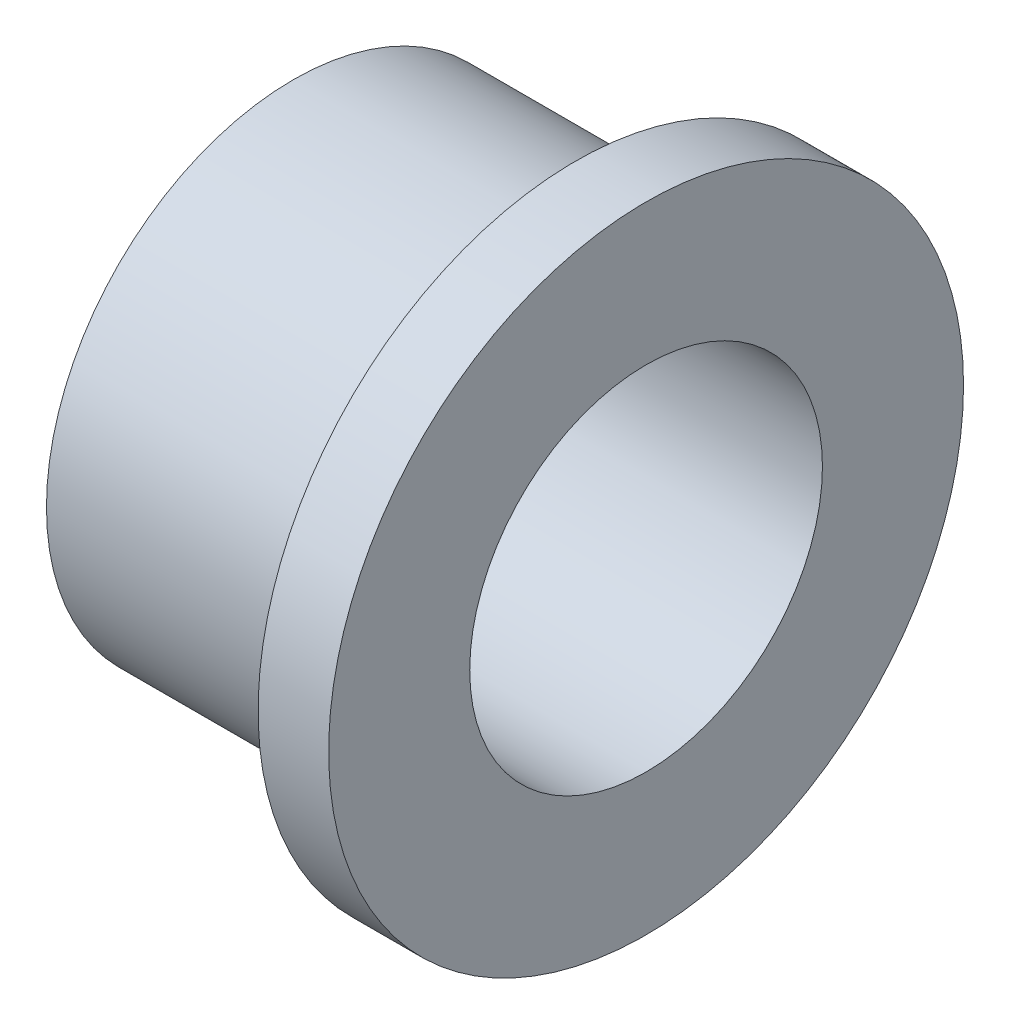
ISO-10303-21;
HEADER;
FILE_DESCRIPTION(('STEP AP214'),'2;1');
FILE_NAME('part.step','',(''),(''),'','','');
FILE_SCHEMA(('AUTOMOTIVE_DESIGN { 1 0 10303 214 1 1 1 1 }'));
ENDSEC;
DATA;
#1=APPLICATION_CONTEXT('core data for automotive mechanical design processes');
#2=APPLICATION_PROTOCOL_DEFINITION('international standard','automotive_design',2000,#1);
#3=PRODUCT_CONTEXT('',#1,'mechanical');
#4=PRODUCT('Part','Part','',(#3));
#5=PRODUCT_RELATED_PRODUCT_CATEGORY('part','',(#4));
#6=PRODUCT_DEFINITION_FORMATION('','',#4);
#7=PRODUCT_DEFINITION_CONTEXT('part definition',#1,'design');
#8=PRODUCT_DEFINITION('design','',#6,#7);
#9=PRODUCT_DEFINITION_SHAPE('','',#8);
#10=(LENGTH_UNIT() NAMED_UNIT(*) SI_UNIT(.MILLI.,.METRE.));
#11=(NAMED_UNIT(*) PLANE_ANGLE_UNIT() SI_UNIT($,.RADIAN.));
#12=(NAMED_UNIT(*) SI_UNIT($,.STERADIAN.) SOLID_ANGLE_UNIT());
#13=UNCERTAINTY_MEASURE_WITH_UNIT(LENGTH_MEASURE(1.E-05),#10,'distance_accuracy_value','');
#14=(GEOMETRIC_REPRESENTATION_CONTEXT(3) GLOBAL_UNCERTAINTY_ASSIGNED_CONTEXT((#13)) GLOBAL_UNIT_ASSIGNED_CONTEXT((#10,
#11,#12)) REPRESENTATION_CONTEXT('',''));
#15=CARTESIAN_POINT('',(0.,0.,0.));
#16=DIRECTION('',(0.,0.,1.));
#17=DIRECTION('',(1.,0.,0.));
#18=AXIS2_PLACEMENT_3D('',#15,#16,#17);
#19=CARTESIAN_POINT('',(-15.875,0.,-11.1125));
#20=DIRECTION('',(-1.,0.,0.));
#21=DIRECTION('',(0.,0.,1.));
#22=AXIS2_PLACEMENT_3D('',#19,#20,#21);
#23=PLANE('',#22);
#24=CARTESIAN_POINT('',(-15.875,0.,0.));
#25=DIRECTION('',(1.,0.,0.));
#26=DIRECTION('',(0.,0.,-1.));
#27=AXIS2_PLACEMENT_3D('',#24,#25,#26);
#28=CIRCLE('',#27,7.9375);
#29=CARTESIAN_POINT('',(-15.875,0.,-7.9375));
#30=VERTEX_POINT('',#29);
#31=EDGE_CURVE('E10',#30,#30,#28,.T.);
#32=ORIENTED_EDGE('',*,*,#31,.T.);
#33=EDGE_LOOP('',(#32));
#34=FACE_BOUND('',#33,.T.);
#35=CARTESIAN_POINT('',(-15.875,0.,0.));
#36=DIRECTION('',(1.,0.,0.));
#37=DIRECTION('',(0.,0.,-1.));
#38=AXIS2_PLACEMENT_3D('',#35,#36,#37);
#39=CIRCLE('',#38,11.1125);
#40=CARTESIAN_POINT('',(-15.875,0.,-11.1125));
#41=VERTEX_POINT('',#40);
#42=EDGE_CURVE('E55',#41,#41,#39,.T.);
#43=ORIENTED_EDGE('',*,*,#42,.F.);
#44=EDGE_LOOP('',(#43));
#45=FACE_BOUND('',#44,.T.);
#46=ADVANCED_FACE('F33',(#34,#45),#23,.T.);
#47=CARTESIAN_POINT('',(0.,0.,0.));
#48=DIRECTION('',(1.,0.,0.));
#49=DIRECTION('',(0.,0.,-1.));
#50=AXIS2_PLACEMENT_3D('',#47,#48,#49);
#51=CYLINDRICAL_SURFACE('',#50,7.9375);
#52=CARTESIAN_POINT('',(0.,0.,0.));
#53=DIRECTION('',(1.,0.,0.));
#54=DIRECTION('',(0.,0.,-1.));
#55=AXIS2_PLACEMENT_3D('',#52,#53,#54);
#56=CIRCLE('',#55,7.9375);
#57=CARTESIAN_POINT('',(0.,0.,-7.9375));
#58=VERTEX_POINT('',#57);
#59=EDGE_CURVE('E39',#58,#58,#56,.T.);
#60=ORIENTED_EDGE('',*,*,#59,.T.);
#61=EDGE_LOOP('',(#60));
#62=FACE_BOUND('',#61,.T.);
#63=ORIENTED_EDGE('',*,*,#31,.F.);
#64=EDGE_LOOP('',(#63));
#65=FACE_BOUND('',#64,.T.);
#66=ADVANCED_FACE('F63',(#62,#65),#51,.F.);
#67=CARTESIAN_POINT('',(0.,0.,-7.9375));
#68=DIRECTION('',(1.,0.,0.));
#69=DIRECTION('',(0.,0.,-1.));
#70=AXIS2_PLACEMENT_3D('',#67,#68,#69);
#71=PLANE('',#70);
#72=CARTESIAN_POINT('',(0.,0.,0.));
#73=DIRECTION('',(1.,0.,0.));
#74=DIRECTION('',(0.,0.,-1.));
#75=AXIS2_PLACEMENT_3D('',#72,#73,#74);
#76=CIRCLE('',#75,14.2875);
#77=CARTESIAN_POINT('',(0.,0.,-14.2875));
#78=VERTEX_POINT('',#77);
#79=EDGE_CURVE('E43',#78,#78,#76,.T.);
#80=ORIENTED_EDGE('',*,*,#79,.T.);
#81=EDGE_LOOP('',(#80));
#82=FACE_BOUND('',#81,.T.);
#83=ORIENTED_EDGE('',*,*,#59,.F.);
#84=EDGE_LOOP('',(#83));
#85=FACE_BOUND('',#84,.T.);
#86=ADVANCED_FACE('F67',(#82,#85),#71,.T.);
#87=CARTESIAN_POINT('',(0.,0.,0.));
#88=DIRECTION('',(1.,0.,0.));
#89=DIRECTION('',(0.,0.,-1.));
#90=AXIS2_PLACEMENT_3D('',#87,#88,#89);
#91=CYLINDRICAL_SURFACE('',#90,14.2875);
#92=CARTESIAN_POINT('',(-3.175,0.,0.));
#93=DIRECTION('',(1.,0.,0.));
#94=DIRECTION('',(0.,0.,-1.));
#95=AXIS2_PLACEMENT_3D('',#92,#93,#94);
#96=CIRCLE('',#95,14.2875);
#97=CARTESIAN_POINT('',(-3.175,0.,-14.2875));
#98=VERTEX_POINT('',#97);
#99=EDGE_CURVE('E47',#98,#98,#96,.T.);
#100=ORIENTED_EDGE('',*,*,#99,.T.);
#101=EDGE_LOOP('',(#100));
#102=FACE_BOUND('',#101,.T.);
#103=ORIENTED_EDGE('',*,*,#79,.F.);
#104=EDGE_LOOP('',(#103));
#105=FACE_BOUND('',#104,.T.);
#106=ADVANCED_FACE('F71',(#102,#105),#91,.T.);
#107=CARTESIAN_POINT('',(-3.175,0.,-14.2875));
#108=DIRECTION('',(-1.,0.,0.));
#109=DIRECTION('',(0.,0.,1.));
#110=AXIS2_PLACEMENT_3D('',#107,#108,#109);
#111=PLANE('',#110);
#112=CARTESIAN_POINT('',(-3.175,0.,0.));
#113=DIRECTION('',(1.,0.,0.));
#114=DIRECTION('',(0.,0.,-1.));
#115=AXIS2_PLACEMENT_3D('',#112,#113,#114);
#116=CIRCLE('',#115,11.1125);
#117=CARTESIAN_POINT('',(-3.175,0.,-11.1125));
#118=VERTEX_POINT('',#117);
#119=EDGE_CURVE('E52',#118,#118,#116,.T.);
#120=ORIENTED_EDGE('',*,*,#119,.T.);
#121=EDGE_LOOP('',(#120));
#122=FACE_BOUND('',#121,.T.);
#123=ORIENTED_EDGE('',*,*,#99,.F.);
#124=EDGE_LOOP('',(#123));
#125=FACE_BOUND('',#124,.T.);
#126=ADVANCED_FACE('F78',(#122,#125),#111,.T.);
#127=CARTESIAN_POINT('',(0.,0.,0.));
#128=DIRECTION('',(1.,0.,0.));
#129=DIRECTION('',(0.,0.,-1.));
#130=AXIS2_PLACEMENT_3D('',#127,#128,#129);
#131=CYLINDRICAL_SURFACE('',#130,11.1125);
#132=ORIENTED_EDGE('',*,*,#42,.T.);
#133=EDGE_LOOP('',(#132));
#134=FACE_BOUND('',#133,.T.);
#135=ORIENTED_EDGE('',*,*,#119,.F.);
#136=EDGE_LOOP('',(#135));
#137=FACE_BOUND('',#136,.T.);
#138=ADVANCED_FACE('F59',(#134,#137),#131,.T.);
#139=CLOSED_SHELL('',(#46,#66,#86,#106,#126,#138));
#140=MANIFOLD_SOLID_BREP('B2',#139);
#141=ADVANCED_BREP_SHAPE_REPRESENTATION('',(#18,#140),#14);
#142=SHAPE_DEFINITION_REPRESENTATION(#9,#141);
ENDSEC;
END-ISO-10303-21;
